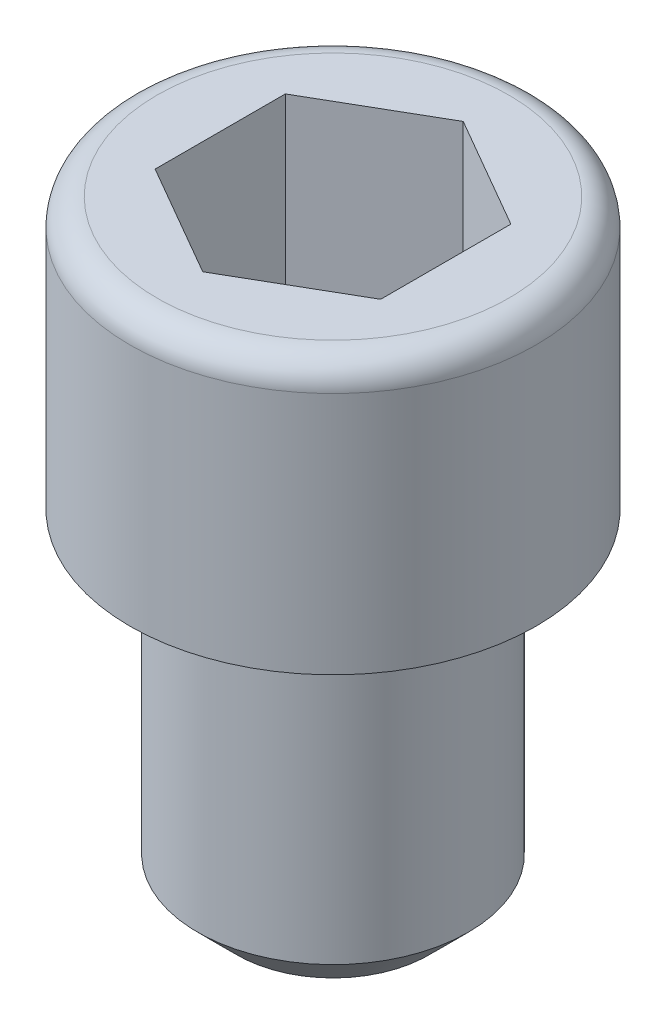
ISO-10303-21;
HEADER;
FILE_DESCRIPTION(('STEP AP214'),'2;1');
FILE_NAME('part.step','',(''),(''),'','','');
FILE_SCHEMA(('AUTOMOTIVE_DESIGN { 1 0 10303 214 1 1 1 1 }'));
ENDSEC;
DATA;
#1=APPLICATION_CONTEXT('core data for automotive mechanical design processes');
#2=APPLICATION_PROTOCOL_DEFINITION('international standard','automotive_design',2000,#1);
#3=PRODUCT_CONTEXT('',#1,'mechanical');
#4=PRODUCT('Part','Part','',(#3));
#5=PRODUCT_RELATED_PRODUCT_CATEGORY('part','',(#4));
#6=PRODUCT_DEFINITION_FORMATION('','',#4);
#7=PRODUCT_DEFINITION_CONTEXT('part definition',#1,'design');
#8=PRODUCT_DEFINITION('design','',#6,#7);
#9=PRODUCT_DEFINITION_SHAPE('','',#8);
#10=(LENGTH_UNIT() NAMED_UNIT(*) SI_UNIT(.MILLI.,.METRE.));
#11=(NAMED_UNIT(*) PLANE_ANGLE_UNIT() SI_UNIT($,.RADIAN.));
#12=(NAMED_UNIT(*) SI_UNIT($,.STERADIAN.) SOLID_ANGLE_UNIT());
#13=UNCERTAINTY_MEASURE_WITH_UNIT(LENGTH_MEASURE(1.E-05),#10,'distance_accuracy_value','');
#14=(GEOMETRIC_REPRESENTATION_CONTEXT(3) GLOBAL_UNCERTAINTY_ASSIGNED_CONTEXT((#13)) GLOBAL_UNIT_ASSIGNED_CONTEXT((#10,
#11,#12)) REPRESENTATION_CONTEXT('',''));
#15=CARTESIAN_POINT('',(0.,0.,0.));
#16=DIRECTION('',(0.,0.,1.));
#17=DIRECTION('',(1.,0.,0.));
#18=AXIS2_PLACEMENT_3D('',#15,#16,#17);
#19=CARTESIAN_POINT('',(4.25000000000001,-27.,0.));
#20=DIRECTION('',(0.,-1.,0.));
#21=DIRECTION('',(1.,0.,0.));
#22=AXIS2_PLACEMENT_3D('',#19,#20,#21);
#23=PLANE('',#22);
#24=CARTESIAN_POINT('',(0.,-27.,0.));
#25=DIRECTION('',(0.,1.,0.));
#26=DIRECTION('',(-1.,0.,0.));
#27=AXIS2_PLACEMENT_3D('',#24,#25,#26);
#28=CIRCLE('',#27,4.25);
#29=CARTESIAN_POINT('',(-4.24999999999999,-27.,0.));
#30=VERTEX_POINT('',#29);
#31=EDGE_CURVE('E11',#30,#30,#28,.T.);
#32=ORIENTED_EDGE('',*,*,#31,.F.);
#33=EDGE_LOOP('',(#32));
#34=FACE_BOUND('',#33,.T.);
#35=ADVANCED_FACE('F348',(#34),#23,.T.);
#36=CARTESIAN_POINT('',(0.,-27.,0.));
#37=DIRECTION('',(0.,1.,0.));
#38=DIRECTION('',(-1.,0.,0.));
#39=AXIS2_PLACEMENT_3D('',#36,#37,#38);
#40=CONICAL_SURFACE('',#39,4.25,0.785398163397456);
#41=CARTESIAN_POINT('',(0.,-25.25,0.));
#42=DIRECTION('',(0.,1.,0.));
#43=DIRECTION('',(-1.,0.,0.));
#44=AXIS2_PLACEMENT_3D('',#41,#42,#43);
#45=CIRCLE('',#44,6.);
#46=CARTESIAN_POINT('',(-5.99999999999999,-25.25,0.));
#47=VERTEX_POINT('',#46);
#48=EDGE_CURVE('E355',#47,#47,#45,.T.);
#49=ORIENTED_EDGE('',*,*,#48,.F.);
#50=EDGE_LOOP('',(#49));
#51=FACE_BOUND('',#50,.T.);
#52=ORIENTED_EDGE('',*,*,#31,.T.);
#53=EDGE_LOOP('',(#52));
#54=FACE_BOUND('',#53,.T.);
#55=ADVANCED_FACE('F471',(#51,#54),#40,.T.);
#56=CARTESIAN_POINT('',(0.,65.1172922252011,0.));
#57=DIRECTION('',(0.,1.,0.));
#58=DIRECTION('',(-1.,0.,0.));
#59=AXIS2_PLACEMENT_3D('',#56,#57,#58);
#60=CYLINDRICAL_SURFACE('',#59,5.99999999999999);
#61=ORIENTED_EDGE('',*,*,#48,.T.);
#62=EDGE_LOOP('',(#61));
#63=FACE_BOUND('',#62,.T.);
#64=CARTESIAN_POINT('',(0.,-12.,0.));
#65=DIRECTION('',(0.,1.,0.));
#66=DIRECTION('',(-1.,0.,0.));
#67=AXIS2_PLACEMENT_3D('',#64,#65,#66);
#68=CIRCLE('',#67,5.99999999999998);
#69=CARTESIAN_POINT('',(-5.99999999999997,-12.,0.));
#70=VERTEX_POINT('',#69);
#71=EDGE_CURVE('E463',#70,#70,#68,.T.);
#72=ORIENTED_EDGE('',*,*,#71,.F.);
#73=EDGE_LOOP('',(#72));
#74=FACE_BOUND('',#73,.T.);
#75=ADVANCED_FACE('F468',(#63,#74),#60,.T.);
#76=CARTESIAN_POINT('',(5.99999999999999,-12.,0.));
#77=DIRECTION('',(0.,1.,0.));
#78=DIRECTION('',(-1.,0.,0.));
#79=AXIS2_PLACEMENT_3D('',#76,#77,#78);
#80=PLANE('',#79);
#81=CARTESIAN_POINT('',(0.,-12.,0.));
#82=DIRECTION('',(0.,1.,0.));
#83=DIRECTION('',(-1.,0.,0.));
#84=AXIS2_PLACEMENT_3D('',#81,#82,#83);
#85=CIRCLE('',#84,8.99999999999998);
#86=CARTESIAN_POINT('',(-8.99999999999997,-12.,0.));
#87=VERTEX_POINT('',#86);
#88=EDGE_CURVE('E460',#87,#87,#85,.T.);
#89=ORIENTED_EDGE('',*,*,#88,.F.);
#90=EDGE_LOOP('',(#89));
#91=FACE_BOUND('',#90,.T.);
#92=ORIENTED_EDGE('',*,*,#71,.T.);
#93=EDGE_LOOP('',(#92));
#94=FACE_BOUND('',#93,.T.);
#95=ADVANCED_FACE('F490',(#91,#94),#80,.F.);
#96=CARTESIAN_POINT('',(0.,65.1172922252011,0.));
#97=DIRECTION('',(0.,1.,0.));
#98=DIRECTION('',(-1.,0.,0.));
#99=AXIS2_PLACEMENT_3D('',#96,#97,#98);
#100=CYLINDRICAL_SURFACE('',#99,8.99999999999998);
#101=CARTESIAN_POINT('',(0.,-1.20000000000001,0.));
#102=DIRECTION('',(0.,1.,0.));
#103=DIRECTION('',(-1.,0.,0.));
#104=AXIS2_PLACEMENT_3D('',#101,#102,#103);
#105=CIRCLE('',#104,8.99999999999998);
#106=CARTESIAN_POINT('',(-8.99999999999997,-1.20000000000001,0.));
#107=VERTEX_POINT('',#106);
#108=EDGE_CURVE('E457',#107,#107,#105,.T.);
#109=ORIENTED_EDGE('',*,*,#108,.F.);
#110=EDGE_LOOP('',(#109));
#111=FACE_BOUND('',#110,.T.);
#112=ORIENTED_EDGE('',*,*,#88,.T.);
#113=EDGE_LOOP('',(#112));
#114=FACE_BOUND('',#113,.T.);
#115=ADVANCED_FACE('F498',(#111,#114),#100,.T.);
#116=CARTESIAN_POINT('',(0.,-1.20000000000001,0.));
#117=DIRECTION('',(0.,1.,0.));
#118=DIRECTION('',(-1.,0.,0.));
#119=AXIS2_PLACEMENT_3D('',#116,#117,#118);
#120=TOROIDAL_SURFACE('',#119,7.79999999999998,1.2);
#121=CARTESIAN_POINT('',(0.,0.,0.));
#122=DIRECTION('',(0.,1.,0.));
#123=DIRECTION('',(-1.,0.,0.));
#124=AXIS2_PLACEMENT_3D('',#121,#122,#123);
#125=CIRCLE('',#124,7.79999999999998);
#126=CARTESIAN_POINT('',(-7.79999999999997,0.,0.));
#127=VERTEX_POINT('',#126);
#128=EDGE_CURVE('E448',#127,#127,#125,.T.);
#129=ORIENTED_EDGE('',*,*,#128,.F.);
#130=EDGE_LOOP('',(#129));
#131=FACE_BOUND('',#130,.T.);
#132=ORIENTED_EDGE('',*,*,#108,.T.);
#133=EDGE_LOOP('',(#132));
#134=FACE_BOUND('',#133,.T.);
#135=ADVANCED_FACE('F506',(#131,#134),#120,.T.);
#136=CARTESIAN_POINT('',(7.79999999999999,0.,0.));
#137=DIRECTION('',(0.,-1.,0.));
#138=DIRECTION('',(1.,0.,0.));
#139=AXIS2_PLACEMENT_3D('',#136,#137,#138);
#140=PLANE('',#139);
#141=DIRECTION('',(0.,0.,1.));
#142=VECTOR('',#141,1.);
#143=CARTESIAN_POINT('',(-5.,0.,-2.88675134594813));
#144=LINE('',#143,#142);
#145=CARTESIAN_POINT('',(-5.,0.,-2.88675134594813));
#146=VERTEX_POINT('',#145);
#147=CARTESIAN_POINT('',(-5.,0.,2.88675134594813));
#148=VERTEX_POINT('',#147);
#149=EDGE_CURVE('E425',#146,#148,#144,.T.);
#150=ORIENTED_EDGE('',*,*,#149,.F.);
#151=DIRECTION('',(-0.866025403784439,0.,0.5));
#152=VECTOR('',#151,1.);
#153=CARTESIAN_POINT('',(0.,0.,-5.77350269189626));
#154=LINE('',#153,#152);
#155=CARTESIAN_POINT('',(0.,0.,-5.77350269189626));
#156=VERTEX_POINT('',#155);
#157=EDGE_CURVE('E362',#156,#146,#154,.T.);
#158=ORIENTED_EDGE('',*,*,#157,.F.);
#159=DIRECTION('',(0.866025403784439,0.,0.5));
#160=VECTOR('',#159,1.);
#161=CARTESIAN_POINT('',(0.,0.,-5.77350269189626));
#162=LINE('',#161,#160);
#163=CARTESIAN_POINT('',(5.,0.,-2.88675134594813));
#164=VERTEX_POINT('',#163);
#165=EDGE_CURVE('E635',#156,#164,#162,.T.);
#166=ORIENTED_EDGE('',*,*,#165,.T.);
#167=DIRECTION('',(0.,0.,1.));
#168=VECTOR('',#167,1.);
#169=CARTESIAN_POINT('',(5.,0.,-2.88675134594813));
#170=LINE('',#169,#168);
#171=CARTESIAN_POINT('',(5.,0.,2.88675134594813));
#172=VERTEX_POINT('',#171);
#173=EDGE_CURVE('E632',#164,#172,#170,.T.);
#174=ORIENTED_EDGE('',*,*,#173,.T.);
#175=DIRECTION('',(-0.866025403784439,0.,0.5));
#176=VECTOR('',#175,1.);
#177=CARTESIAN_POINT('',(5.,0.,2.88675134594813));
#178=LINE('',#177,#176);
#179=CARTESIAN_POINT('',(0.,0.,5.77350269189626));
#180=VERTEX_POINT('',#179);
#181=EDGE_CURVE('E629',#172,#180,#178,.T.);
#182=ORIENTED_EDGE('',*,*,#181,.T.);
#183=DIRECTION('',(0.866025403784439,0.,0.5));
#184=VECTOR('',#183,1.);
#185=CARTESIAN_POINT('',(-5.,0.,2.88675134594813));
#186=LINE('',#185,#184);
#187=EDGE_CURVE('E627',#148,#180,#186,.T.);
#188=ORIENTED_EDGE('',*,*,#187,.F.);
#189=EDGE_LOOP('',(#150,#158,#166,#174,#182,#188));
#190=FACE_BOUND('',#189,.T.);
#191=ORIENTED_EDGE('',*,*,#128,.T.);
#192=EDGE_LOOP('',(#191));
#193=FACE_BOUND('',#192,.T.);
#194=ADVANCED_FACE('F514',(#190,#193),#140,.F.);
#195=CARTESIAN_POINT('',(0.,-8.64,-5.77350269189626));
#196=DIRECTION('',(-0.5,0.,-0.866025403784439));
#197=DIRECTION('',(-0.866025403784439,0.,0.5));
#198=AXIS2_PLACEMENT_3D('',#195,#196,#197);
#199=PLANE('',#198);
#200=ORIENTED_EDGE('',*,*,#157,.T.);
#201=DIRECTION('',(0.,1.,0.));
#202=VECTOR('',#201,1.);
#203=CARTESIAN_POINT('',(-5.,-8.64,-2.88675134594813));
#204=LINE('',#203,#202);
#205=CARTESIAN_POINT('',(-5.,-8.64,-2.88675134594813));
#206=VERTEX_POINT('',#205);
#207=EDGE_CURVE('E430',#206,#146,#204,.T.);
#208=ORIENTED_EDGE('',*,*,#207,.F.);
#209=DIRECTION('',(-0.866025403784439,0.,0.5));
#210=VECTOR('',#209,1.);
#211=CARTESIAN_POINT('',(0.,-8.64,-5.77350269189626));
#212=LINE('',#211,#210);
#213=CARTESIAN_POINT('',(0.,-8.64,-5.77350269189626));
#214=VERTEX_POINT('',#213);
#215=EDGE_CURVE('E419',#214,#206,#212,.T.);
#216=ORIENTED_EDGE('',*,*,#215,.F.);
#217=DIRECTION('',(0.,1.,0.));
#218=VECTOR('',#217,1.);
#219=CARTESIAN_POINT('',(0.,-8.64,-5.77350269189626));
#220=LINE('',#219,#218);
#221=EDGE_CURVE('E446',#214,#156,#220,.T.);
#222=ORIENTED_EDGE('',*,*,#221,.T.);
#223=EDGE_LOOP('',(#200,#208,#216,#222));
#224=FACE_BOUND('',#223,.T.);
#225=ADVANCED_FACE('F522',(#224),#199,.F.);
#226=CARTESIAN_POINT('',(0.,-8.64,-5.77350269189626));
#227=DIRECTION('',(-0.5,0.,0.866025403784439));
#228=DIRECTION('',(0.866025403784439,0.,0.5));
#229=AXIS2_PLACEMENT_3D('',#226,#227,#228);
#230=PLANE('',#229);
#231=ORIENTED_EDGE('',*,*,#165,.F.);
#232=ORIENTED_EDGE('',*,*,#221,.F.);
#233=DIRECTION('',(0.866025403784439,0.,0.5));
#234=VECTOR('',#233,1.);
#235=CARTESIAN_POINT('',(0.,-8.64,-5.77350269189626));
#236=LINE('',#235,#234);
#237=CARTESIAN_POINT('',(5.,-8.64,-2.88675134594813));
#238=VERTEX_POINT('',#237);
#239=EDGE_CURVE('E443',#214,#238,#236,.T.);
#240=ORIENTED_EDGE('',*,*,#239,.T.);
#241=DIRECTION('',(0.,1.,0.));
#242=VECTOR('',#241,1.);
#243=CARTESIAN_POINT('',(5.,-8.64,-2.88675134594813));
#244=LINE('',#243,#242);
#245=EDGE_CURVE('E449',#238,#164,#244,.T.);
#246=ORIENTED_EDGE('',*,*,#245,.T.);
#247=EDGE_LOOP('',(#231,#232,#240,#246));
#248=FACE_BOUND('',#247,.T.);
#249=ADVANCED_FACE('F530',(#248),#230,.T.);
#250=CARTESIAN_POINT('',(5.,-8.64,-2.88675134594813));
#251=DIRECTION('',(-1.,0.,0.));
#252=DIRECTION('',(0.,-1.,0.));
#253=AXIS2_PLACEMENT_3D('',#250,#251,#252);
#254=PLANE('',#253);
#255=ORIENTED_EDGE('',*,*,#173,.F.);
#256=ORIENTED_EDGE('',*,*,#245,.F.);
#257=DIRECTION('',(0.,0.,1.));
#258=VECTOR('',#257,1.);
#259=CARTESIAN_POINT('',(5.,-8.64,-2.88675134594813));
#260=LINE('',#259,#258);
#261=CARTESIAN_POINT('',(5.,-8.64,2.88675134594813));
#262=VERTEX_POINT('',#261);
#263=EDGE_CURVE('E437',#238,#262,#260,.T.);
#264=ORIENTED_EDGE('',*,*,#263,.T.);
#265=DIRECTION('',(0.,1.,0.));
#266=VECTOR('',#265,1.);
#267=CARTESIAN_POINT('',(5.,-8.64,2.88675134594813));
#268=LINE('',#267,#266);
#269=EDGE_CURVE('E451',#262,#172,#268,.T.);
#270=ORIENTED_EDGE('',*,*,#269,.T.);
#271=EDGE_LOOP('',(#255,#256,#264,#270));
#272=FACE_BOUND('',#271,.T.);
#273=ADVANCED_FACE('F537',(#272),#254,.T.);
#274=CARTESIAN_POINT('',(5.,-8.64,2.88675134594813));
#275=DIRECTION('',(-0.5,0.,-0.866025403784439));
#276=DIRECTION('',(-0.866025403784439,0.,0.5));
#277=AXIS2_PLACEMENT_3D('',#274,#275,#276);
#278=PLANE('',#277);
#279=ORIENTED_EDGE('',*,*,#181,.F.);
#280=ORIENTED_EDGE('',*,*,#269,.F.);
#281=DIRECTION('',(-0.866025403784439,0.,0.5));
#282=VECTOR('',#281,1.);
#283=CARTESIAN_POINT('',(5.,-8.64,2.88675134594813));
#284=LINE('',#283,#282);
#285=CARTESIAN_POINT('',(0.,-8.64,5.77350269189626));
#286=VERTEX_POINT('',#285);
#287=EDGE_CURVE('E434',#262,#286,#284,.T.);
#288=ORIENTED_EDGE('',*,*,#287,.T.);
#289=DIRECTION('',(0.,1.,0.));
#290=VECTOR('',#289,1.);
#291=CARTESIAN_POINT('',(0.,-8.64,5.77350269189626));
#292=LINE('',#291,#290);
#293=EDGE_CURVE('E429',#286,#180,#292,.T.);
#294=ORIENTED_EDGE('',*,*,#293,.T.);
#295=EDGE_LOOP('',(#279,#280,#288,#294));
#296=FACE_BOUND('',#295,.T.);
#297=ADVANCED_FACE('F545',(#296),#278,.T.);
#298=CARTESIAN_POINT('',(-5.,-8.64,2.88675134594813));
#299=DIRECTION('',(-0.5,0.,0.866025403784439));
#300=DIRECTION('',(0.866025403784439,0.,0.5));
#301=AXIS2_PLACEMENT_3D('',#298,#299,#300);
#302=PLANE('',#301);
#303=ORIENTED_EDGE('',*,*,#187,.T.);
#304=ORIENTED_EDGE('',*,*,#293,.F.);
#305=DIRECTION('',(0.866025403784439,0.,0.5));
#306=VECTOR('',#305,1.);
#307=CARTESIAN_POINT('',(-5.,-8.64,2.88675134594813));
#308=LINE('',#307,#306);
#309=CARTESIAN_POINT('',(-5.,-8.64,2.88675134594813));
#310=VERTEX_POINT('',#309);
#311=EDGE_CURVE('E370',#310,#286,#308,.T.);
#312=ORIENTED_EDGE('',*,*,#311,.F.);
#313=DIRECTION('',(0.,1.,0.));
#314=VECTOR('',#313,1.);
#315=CARTESIAN_POINT('',(-5.,-8.64,2.88675134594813));
#316=LINE('',#315,#314);
#317=EDGE_CURVE('E422',#310,#148,#316,.T.);
#318=ORIENTED_EDGE('',*,*,#317,.T.);
#319=EDGE_LOOP('',(#303,#304,#312,#318));
#320=FACE_BOUND('',#319,.T.);
#321=ADVANCED_FACE('F433',(#320),#302,.F.);
#322=CARTESIAN_POINT('',(-5.,-8.64,-2.88675134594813));
#323=DIRECTION('',(-1.,0.,0.));
#324=DIRECTION('',(0.,-1.,0.));
#325=AXIS2_PLACEMENT_3D('',#322,#323,#324);
#326=PLANE('',#325);
#327=ORIENTED_EDGE('',*,*,#149,.T.);
#328=ORIENTED_EDGE('',*,*,#317,.F.);
#329=DIRECTION('',(0.,0.,1.));
#330=VECTOR('',#329,1.);
#331=CARTESIAN_POINT('',(-5.,-8.64,-2.88675134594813));
#332=LINE('',#331,#330);
#333=EDGE_CURVE('E412',#206,#310,#332,.T.);
#334=ORIENTED_EDGE('',*,*,#333,.F.);
#335=ORIENTED_EDGE('',*,*,#207,.T.);
#336=EDGE_LOOP('',(#327,#328,#334,#335));
#337=FACE_BOUND('',#336,.T.);
#338=ADVANCED_FACE('F423',(#337),#326,.F.);
#339=CARTESIAN_POINT('',(-5.,-8.64,-2.88675134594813));
#340=DIRECTION('',(0.0942779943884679,0.98206244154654,0.16329427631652));
#341=DIRECTION('',(0.,-0.164024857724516,0.986456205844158));
#342=AXIS2_PLACEMENT_3D('',#339,#340,#341);
#343=PLANE('',#342);
#344=DIRECTION('',(-0.854296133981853,0.164024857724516,-0.493228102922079));
#345=VECTOR('',#344,1.);
#346=CARTESIAN_POINT('',(0.,-9.6,0.));
#347=LINE('',#346,#345);
#348=CARTESIAN_POINT('',(0.,-9.6,0.));
#349=VERTEX_POINT('',#348);
#350=EDGE_CURVE('E416',#349,#206,#347,.T.);
#351=ORIENTED_EDGE('',*,*,#350,.F.);
#352=DIRECTION('',(0.,0.164024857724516,-0.986456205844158));
#353=VECTOR('',#352,1.);
#354=CARTESIAN_POINT('',(0.,-9.6,0.));
#355=LINE('',#354,#353);
#356=EDGE_CURVE('E616',#349,#214,#355,.T.);
#357=ORIENTED_EDGE('',*,*,#356,.T.);
#358=ORIENTED_EDGE('',*,*,#215,.T.);
#359=EDGE_LOOP('',(#351,#357,#358));
#360=FACE_BOUND('',#359,.T.);
#361=ADVANCED_FACE('F566',(#360),#343,.T.);
#362=CARTESIAN_POINT('',(0.,-8.64,-5.77350269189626));
#363=DIRECTION('',(-0.0942779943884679,0.98206244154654,0.16329427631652));
#364=DIRECTION('',(0.,-0.164024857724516,0.986456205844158));
#365=AXIS2_PLACEMENT_3D('',#362,#363,#364);
#366=PLANE('',#365);
#367=ORIENTED_EDGE('',*,*,#356,.F.);
#368=DIRECTION('',(0.854296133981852,0.164024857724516,-0.493228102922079));
#369=VECTOR('',#368,1.);
#370=CARTESIAN_POINT('',(0.,-9.6,0.));
#371=LINE('',#370,#369);
#372=EDGE_CURVE('E408',#349,#238,#371,.T.);
#373=ORIENTED_EDGE('',*,*,#372,.T.);
#374=ORIENTED_EDGE('',*,*,#239,.F.);
#375=EDGE_LOOP('',(#367,#373,#374));
#376=FACE_BOUND('',#375,.T.);
#377=ADVANCED_FACE('F574',(#376),#366,.T.);
#378=CARTESIAN_POINT('',(-5.,-8.64,2.88675134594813));
#379=DIRECTION('',(0.188555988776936,0.98206244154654,0.));
#380=DIRECTION('',(-0.98206244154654,0.188555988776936,0.));
#381=AXIS2_PLACEMENT_3D('',#378,#379,#380);
#382=PLANE('',#381);
#383=DIRECTION('',(-0.854296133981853,0.164024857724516,0.493228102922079));
#384=VECTOR('',#383,1.);
#385=CARTESIAN_POINT('',(0.,-9.6,0.));
#386=LINE('',#385,#384);
#387=EDGE_CURVE('E402',#349,#310,#386,.T.);
#388=ORIENTED_EDGE('',*,*,#387,.F.);
#389=ORIENTED_EDGE('',*,*,#350,.T.);
#390=ORIENTED_EDGE('',*,*,#333,.T.);
#391=EDGE_LOOP('',(#388,#389,#390));
#392=FACE_BOUND('',#391,.T.);
#393=ADVANCED_FACE('F414',(#392),#382,.T.);
#394=CARTESIAN_POINT('',(5.,-8.64,-2.88675134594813));
#395=DIRECTION('',(-0.188555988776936,0.98206244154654,0.));
#396=DIRECTION('',(-0.98206244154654,-0.188555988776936,0.));
#397=AXIS2_PLACEMENT_3D('',#394,#395,#396);
#398=PLANE('',#397);
#399=ORIENTED_EDGE('',*,*,#372,.F.);
#400=DIRECTION('',(0.854296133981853,0.164024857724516,0.493228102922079));
#401=VECTOR('',#400,1.);
#402=CARTESIAN_POINT('',(0.,-9.6,0.));
#403=LINE('',#402,#401);
#404=EDGE_CURVE('E409',#349,#262,#403,.T.);
#405=ORIENTED_EDGE('',*,*,#404,.T.);
#406=ORIENTED_EDGE('',*,*,#263,.F.);
#407=EDGE_LOOP('',(#399,#405,#406));
#408=FACE_BOUND('',#407,.T.);
#409=ADVANCED_FACE('F589',(#408),#398,.T.);
#410=CARTESIAN_POINT('',(0.,-8.64,5.77350269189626));
#411=DIRECTION('',(0.094277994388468,0.982062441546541,-0.16329427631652));
#412=DIRECTION('',(0.,0.164024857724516,0.986456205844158));
#413=AXIS2_PLACEMENT_3D('',#410,#411,#412);
#414=PLANE('',#413);
#415=DIRECTION('',(0.,0.164024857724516,0.986456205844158));
#416=VECTOR('',#415,1.);
#417=CARTESIAN_POINT('',(0.,-9.6,0.));
#418=LINE('',#417,#416);
#419=EDGE_CURVE('E405',#349,#286,#418,.T.);
#420=ORIENTED_EDGE('',*,*,#419,.F.);
#421=ORIENTED_EDGE('',*,*,#387,.T.);
#422=ORIENTED_EDGE('',*,*,#311,.T.);
#423=EDGE_LOOP('',(#420,#421,#422));
#424=FACE_BOUND('',#423,.T.);
#425=ADVANCED_FACE('F404',(#424),#414,.T.);
#426=CARTESIAN_POINT('',(5.,-8.64,2.88675134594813));
#427=DIRECTION('',(-0.094277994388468,0.98206244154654,-0.16329427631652));
#428=DIRECTION('',(0.,0.164024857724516,0.986456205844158));
#429=AXIS2_PLACEMENT_3D('',#426,#427,#428);
#430=PLANE('',#429);
#431=ORIENTED_EDGE('',*,*,#404,.F.);
#432=ORIENTED_EDGE('',*,*,#419,.T.);
#433=ORIENTED_EDGE('',*,*,#287,.F.);
#434=EDGE_LOOP('',(#431,#432,#433));
#435=FACE_BOUND('',#434,.T.);
#436=ADVANCED_FACE('F568',(#435),#430,.T.);
#437=CLOSED_SHELL('',(#35,#55,#75,#95,#115,#135,#194,#225,#249,#273,#297,#321,#338,#361,#377,
#393,#409,#425,#436));
#438=MANIFOLD_SOLID_BREP('B2',#437);
#439=ADVANCED_BREP_SHAPE_REPRESENTATION('',(#18,#438),#14);
#440=SHAPE_DEFINITION_REPRESENTATION(#9,#439);
ENDSEC;
END-ISO-10303-21;
